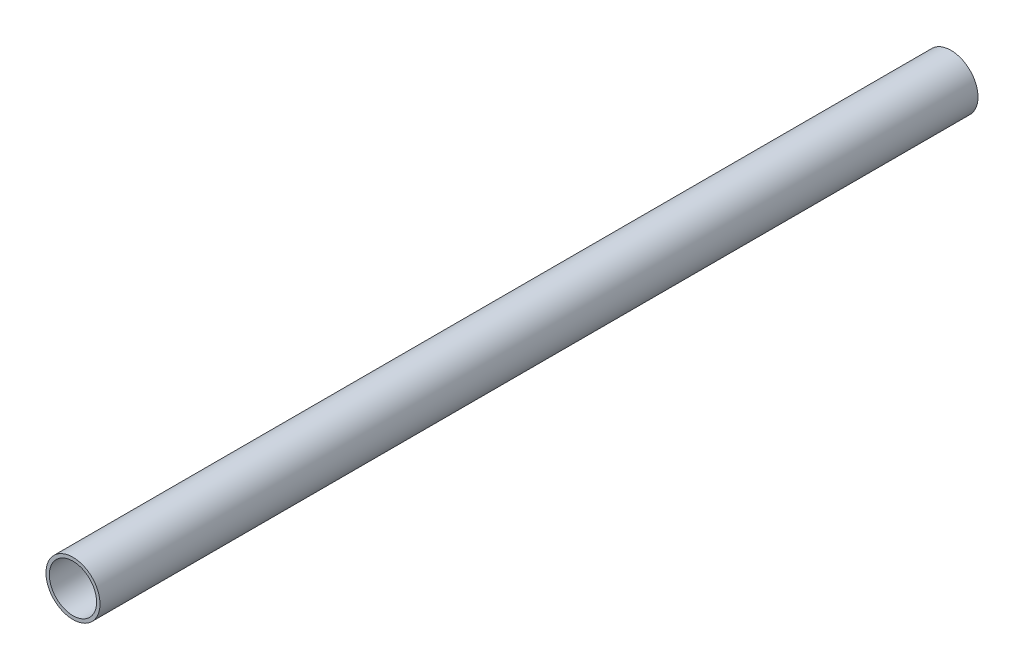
from build123d import *

# Parameters (mm, degrees)
ESQUISSE1_R      = 1.2
ESQUISSE1_R_2    = 1.05
EXTRUSION1_DEPTH = 39


with BuildPart() as part:
    # Esquisse1 → Extrusion1 (new body)
    with BuildSketch(Plane.XY):
        Circle(ESQUISSE1_R)
        Circle(ESQUISSE1_R_2, mode=Mode.SUBTRACT)
    extrude(amount=EXTRUSION1_DEPTH)


solid = part.part
